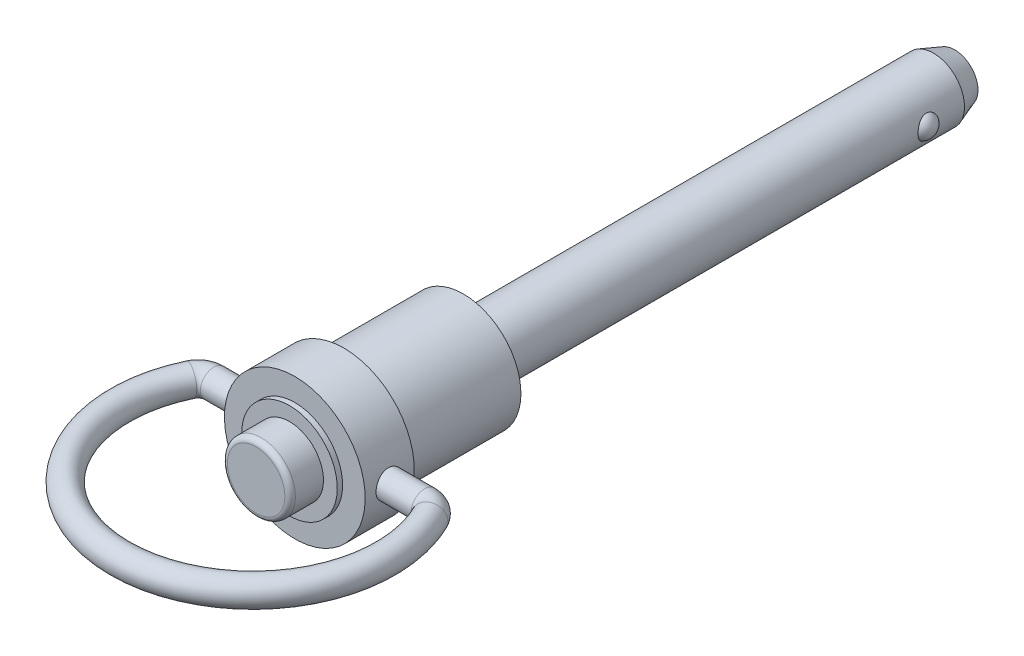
ISO-10303-21;
HEADER;
FILE_DESCRIPTION(('STEP AP214'),'2;1');
FILE_NAME('part.step','',(''),(''),'','','');
FILE_SCHEMA(('AUTOMOTIVE_DESIGN { 1 0 10303 214 1 1 1 1 }'));
ENDSEC;
DATA;
#1=APPLICATION_CONTEXT('core data for automotive mechanical design processes');
#2=APPLICATION_PROTOCOL_DEFINITION('international standard','automotive_design',2000,#1);
#3=PRODUCT_CONTEXT('',#1,'mechanical');
#4=PRODUCT('Part','Part','',(#3));
#5=PRODUCT_RELATED_PRODUCT_CATEGORY('part','',(#4));
#6=PRODUCT_DEFINITION_FORMATION('','',#4);
#7=PRODUCT_DEFINITION_CONTEXT('part definition',#1,'design');
#8=PRODUCT_DEFINITION('design','',#6,#7);
#9=PRODUCT_DEFINITION_SHAPE('','',#8);
#10=(LENGTH_UNIT() NAMED_UNIT(*) SI_UNIT(.MILLI.,.METRE.));
#11=(NAMED_UNIT(*) PLANE_ANGLE_UNIT() SI_UNIT($,.RADIAN.));
#12=(NAMED_UNIT(*) SI_UNIT($,.STERADIAN.) SOLID_ANGLE_UNIT());
#13=UNCERTAINTY_MEASURE_WITH_UNIT(LENGTH_MEASURE(1.E-05),#10,'distance_accuracy_value','');
#14=(GEOMETRIC_REPRESENTATION_CONTEXT(3) GLOBAL_UNCERTAINTY_ASSIGNED_CONTEXT((#13)) GLOBAL_UNIT_ASSIGNED_CONTEXT((#10,
#11,#12)) REPRESENTATION_CONTEXT('',''));
#15=CARTESIAN_POINT('',(0.,0.,0.));
#16=DIRECTION('',(0.,0.,1.));
#17=DIRECTION('',(1.,0.,0.));
#18=AXIS2_PLACEMENT_3D('',#15,#16,#17);
#19=CARTESIAN_POINT('',(0.,0.,20.828));
#20=DIRECTION('',(0.,0.,-1.));
#21=DIRECTION('',(0.,1.,0.));
#22=AXIS2_PLACEMENT_3D('',#19,#20,#21);
#23=CYLINDRICAL_SURFACE('',#22,3.2512);
#24=CARTESIAN_POINT('',(0.,0.,16.637));
#25=DIRECTION('',(0.,0.,-1.));
#26=DIRECTION('',(0.,1.,0.));
#27=AXIS2_PLACEMENT_3D('',#24,#25,#26);
#28=CIRCLE('',#27,3.2512);
#29=CARTESIAN_POINT('',(0.,3.2512,16.637));
#30=VERTEX_POINT('',#29);
#31=EDGE_CURVE('E35',#30,#30,#28,.T.);
#32=ORIENTED_EDGE('',*,*,#31,.F.);
#33=EDGE_LOOP('',(#32));
#34=FACE_BOUND('',#33,.T.);
#35=CARTESIAN_POINT('',(0.,0.,19.328));
#36=DIRECTION('',(0.,0.,1.));
#37=DIRECTION('',(1.,0.,0.));
#38=AXIS2_PLACEMENT_3D('',#35,#36,#37);
#39=CIRCLE('',#38,3.2512);
#40=CARTESIAN_POINT('',(3.2512,0.,19.328));
#41=VERTEX_POINT('',#40);
#42=EDGE_CURVE('E157',#41,#41,#39,.T.);
#43=ORIENTED_EDGE('',*,*,#42,.F.);
#44=EDGE_LOOP('',(#43));
#45=FACE_BOUND('',#44,.T.);
#46=ADVANCED_FACE('F13',(#34,#45),#23,.T.);
#47=CARTESIAN_POINT('',(4.572,0.,16.637));
#48=DIRECTION('',(0.,0.,1.));
#49=DIRECTION('',(0.,-1.,0.));
#50=AXIS2_PLACEMENT_3D('',#47,#48,#49);
#51=PLANE('',#50);
#52=ORIENTED_EDGE('',*,*,#31,.T.);
#53=EDGE_LOOP('',(#52));
#54=FACE_BOUND('',#53,.T.);
#55=CARTESIAN_POINT('',(0.,0.,16.637));
#56=DIRECTION('',(0.,0.,-1.));
#57=DIRECTION('',(0.,1.,0.));
#58=AXIS2_PLACEMENT_3D('',#55,#56,#57);
#59=CIRCLE('',#58,4.572);
#60=CARTESIAN_POINT('',(0.,4.572,16.637));
#61=VERTEX_POINT('',#60);
#62=EDGE_CURVE('E40',#61,#61,#59,.T.);
#63=ORIENTED_EDGE('',*,*,#62,.F.);
#64=EDGE_LOOP('',(#63));
#65=FACE_BOUND('',#64,.T.);
#66=ADVANCED_FACE('F81',(#54,#65),#51,.T.);
#67=CARTESIAN_POINT('',(0.,0.,0.));
#68=DIRECTION('',(0.,0.,-1.));
#69=DIRECTION('',(0.,1.,0.));
#70=AXIS2_PLACEMENT_3D('',#67,#68,#69);
#71=CYLINDRICAL_SURFACE('',#70,4.572);
#72=ORIENTED_EDGE('',*,*,#62,.T.);
#73=EDGE_LOOP('',(#72));
#74=FACE_BOUND('',#73,.T.);
#75=CARTESIAN_POINT('',(0.,0.,16.129));
#76=DIRECTION('',(0.,0.,-1.));
#77=DIRECTION('',(0.,1.,0.));
#78=AXIS2_PLACEMENT_3D('',#75,#76,#77);
#79=CIRCLE('',#78,4.572);
#80=CARTESIAN_POINT('',(0.,4.572,16.129));
#81=VERTEX_POINT('',#80);
#82=EDGE_CURVE('E43',#81,#81,#79,.T.);
#83=ORIENTED_EDGE('',*,*,#82,.F.);
#84=EDGE_LOOP('',(#83));
#85=FACE_BOUND('',#84,.T.);
#86=ADVANCED_FACE('F151',(#74,#85),#71,.T.);
#87=CARTESIAN_POINT('',(6.731,0.,16.129));
#88=DIRECTION('',(0.,0.,1.));
#89=DIRECTION('',(0.,-1.,0.));
#90=AXIS2_PLACEMENT_3D('',#87,#88,#89);
#91=PLANE('',#90);
#92=CARTESIAN_POINT('',(0.,0.,16.129));
#93=DIRECTION('',(0.,0.,-1.));
#94=DIRECTION('',(0.,1.,0.));
#95=AXIS2_PLACEMENT_3D('',#92,#93,#94);
#96=CIRCLE('',#95,6.731);
#97=CARTESIAN_POINT('',(0.,6.731,16.129));
#98=VERTEX_POINT('',#97);
#99=EDGE_CURVE('E46',#98,#98,#96,.T.);
#100=ORIENTED_EDGE('',*,*,#99,.F.);
#101=EDGE_LOOP('',(#100));
#102=FACE_BOUND('',#101,.T.);
#103=ORIENTED_EDGE('',*,*,#82,.T.);
#104=EDGE_LOOP('',(#103));
#105=FACE_BOUND('',#104,.T.);
#106=ADVANCED_FACE('F194',(#102,#105),#91,.T.);
#107=CARTESIAN_POINT('',(0.,0.,0.));
#108=DIRECTION('',(0.,0.,-1.));
#109=DIRECTION('',(0.,1.,0.));
#110=AXIS2_PLACEMENT_3D('',#107,#108,#109);
#111=CYLINDRICAL_SURFACE('',#110,6.731);
#112=CARTESIAN_POINT('',(0.,0.,11.43));
#113=DIRECTION('',(0.,0.,-1.));
#114=DIRECTION('',(0.,1.,0.));
#115=AXIS2_PLACEMENT_3D('',#112,#113,#114);
#116=CIRCLE('',#115,6.731);
#117=CARTESIAN_POINT('',(0.,6.731,11.43));
#118=VERTEX_POINT('',#117);
#119=EDGE_CURVE('E34',#118,#118,#116,.T.);
#120=ORIENTED_EDGE('',*,*,#119,.F.);
#121=EDGE_LOOP('',(#120));
#122=FACE_BOUND('',#121,.T.);
#123=ORIENTED_EDGE('',*,*,#99,.T.);
#124=EDGE_LOOP('',(#123));
#125=FACE_BOUND('',#124,.T.);
#126=CARTESIAN_POINT('',(-6.6051722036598,1.2954,13.7922));
#127=CARTESIAN_POINT('',(-6.60517361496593,1.2953972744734,13.864236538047));
#128=CARTESIAN_POINT('',(-6.60636346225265,1.28937073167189,13.9363080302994));
#129=CARTESIAN_POINT('',(-6.61098794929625,1.26544153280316,14.0784162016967));
#130=CARTESIAN_POINT('',(-6.61442445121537,1.24752902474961,14.1484511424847));
#131=CARTESIAN_POINT('',(-6.62313895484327,1.20040052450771,14.2844095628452));
#132=CARTESIAN_POINT('',(-6.62841519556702,1.17119533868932,14.3503369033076));
#133=CARTESIAN_POINT('',(-6.64021258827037,1.10233951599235,14.4763528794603));
#134=CARTESIAN_POINT('',(-6.64673365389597,1.06268960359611,14.5364419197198));
#135=CARTESIAN_POINT('',(-6.66038139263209,0.973516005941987,14.6498669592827));
#136=CARTESIAN_POINT('',(-6.66751428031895,0.9238817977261,14.7031153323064));
#137=CARTESIAN_POINT('',(-6.68152715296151,0.816387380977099,14.8005834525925));
#138=CARTESIAN_POINT('',(-6.6884071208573,0.758526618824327,14.8448025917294));
#139=CARTESIAN_POINT('',(-6.7012057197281,0.635644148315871,14.9232944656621));
#140=CARTESIAN_POINT('',(-6.70711617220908,0.570568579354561,14.9574843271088));
#141=CARTESIAN_POINT('',(-6.71724013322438,0.435464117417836,15.014412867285));
#142=CARTESIAN_POINT('',(-6.72145378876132,0.365435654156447,15.0371525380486));
#143=CARTESIAN_POINT('',(-6.72766549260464,0.223321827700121,15.0702635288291));
#144=CARTESIAN_POINT('',(-6.72968999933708,0.151272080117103,15.0807826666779));
#145=CARTESIAN_POINT('',(-6.73138656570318,0.00640388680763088,15.089614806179));
#146=CARTESIAN_POINT('',(-6.73105883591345,-0.0664144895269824,15.0879289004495));
#147=CARTESIAN_POINT('',(-6.72810846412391,-0.209738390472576,15.072511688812));
#148=CARTESIAN_POINT('',(-6.72551615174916,-0.280261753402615,15.0589395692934));
#149=CARTESIAN_POINT('',(-6.71836197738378,-0.418011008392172,15.0203872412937));
#150=CARTESIAN_POINT('',(-6.71380004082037,-0.485236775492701,14.9954066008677));
#151=CARTESIAN_POINT('',(-6.70316878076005,-0.614941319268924,14.9345963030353));
#152=CARTESIAN_POINT('',(-6.69709072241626,-0.67738974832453,14.8987035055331));
#153=CARTESIAN_POINT('',(-6.68409856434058,-0.795436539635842,14.8171343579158));
#154=CARTESIAN_POINT('',(-6.677184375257,-0.851034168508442,14.7714569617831));
#155=CARTESIAN_POINT('',(-6.66315320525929,-0.954744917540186,14.6707395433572));
#156=CARTESIAN_POINT('',(-6.65603475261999,-1.00272266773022,14.6155602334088));
#157=CARTESIAN_POINT('',(-6.64250376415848,-1.08876420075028,14.4978679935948));
#158=CARTESIAN_POINT('',(-6.63609123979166,-1.12682782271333,14.4353549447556));
#159=CARTESIAN_POINT('',(-6.62469571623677,-1.19200234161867,14.3045844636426));
#160=CARTESIAN_POINT('',(-6.61971540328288,-1.21909269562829,14.2363165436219));
#161=CARTESIAN_POINT('',(-6.61178862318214,-1.26138008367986,14.0960804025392));
#162=CARTESIAN_POINT('',(-6.60884191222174,-1.27657854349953,14.0241126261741));
#163=CARTESIAN_POINT('',(-6.60536444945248,-1.29445125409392,13.8797427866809));
#164=CARTESIAN_POINT('',(-6.60479610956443,-1.29732037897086,13.8073657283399));
#165=CARTESIAN_POINT('',(-6.60603903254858,-1.29097613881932,13.6631669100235));
#166=CARTESIAN_POINT('',(-6.60785017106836,-1.28176340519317,13.5913451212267));
#167=CARTESIAN_POINT('',(-6.6136128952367,-1.25168453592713,13.4509418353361));
#168=CARTESIAN_POINT('',(-6.61754556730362,-1.23092132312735,13.3823374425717));
#169=CARTESIAN_POINT('',(-6.62709183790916,-1.17844042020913,13.249581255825));
#170=CARTESIAN_POINT('',(-6.63270556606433,-1.14672188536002,13.1854298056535));
#171=CARTESIAN_POINT('',(-6.6450665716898,-1.07278507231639,13.0625442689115));
#172=CARTESIAN_POINT('',(-6.65182676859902,-1.03044414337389,13.0038853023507));
#173=CARTESIAN_POINT('',(-6.66568301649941,-0.936629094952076,12.8944341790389));
#174=CARTESIAN_POINT('',(-6.67277909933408,-0.885154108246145,12.8436427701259));
#175=CARTESIAN_POINT('',(-6.68662882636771,-0.773660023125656,12.7506362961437));
#176=CARTESIAN_POINT('',(-6.69337621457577,-0.713530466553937,12.7085525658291));
#177=CARTESIAN_POINT('',(-6.70566168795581,-0.586941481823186,12.6350847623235));
#178=CARTESIAN_POINT('',(-6.71119982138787,-0.520482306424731,12.6037002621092));
#179=CARTESIAN_POINT('',(-6.72041595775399,-0.383476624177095,12.5527164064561));
#180=CARTESIAN_POINT('',(-6.72410395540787,-0.312954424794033,12.5330536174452));
#181=CARTESIAN_POINT('',(-6.72924701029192,-0.169530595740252,12.5058694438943));
#182=CARTESIAN_POINT('',(-6.7307023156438,-0.0966292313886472,12.4983467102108));
#183=CARTESIAN_POINT('',(-6.73121071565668,0.0482259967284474,12.4957052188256));
#184=CARTESIAN_POINT('',(-6.73030215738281,0.120176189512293,12.5003884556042));
#185=CARTESIAN_POINT('',(-6.72626496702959,0.26224403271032,12.5215909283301));
#186=CARTESIAN_POINT('',(-6.72313635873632,0.332361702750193,12.5381100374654));
#187=CARTESIAN_POINT('',(-6.71501101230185,0.468662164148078,12.5824301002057));
#188=CARTESIAN_POINT('',(-6.710017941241,0.534852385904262,12.6102089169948));
#189=CARTESIAN_POINT('',(-6.69870305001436,0.661661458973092,12.6762356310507));
#190=CARTESIAN_POINT('',(-6.69238113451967,0.722279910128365,12.7144842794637));
#191=CARTESIAN_POINT('',(-6.6789853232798,0.837208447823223,12.8010411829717));
#192=CARTESIAN_POINT('',(-6.67190155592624,0.891410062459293,12.8494919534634));
#193=CARTESIAN_POINT('',(-6.65784127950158,0.990982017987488,12.95478313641));
#194=CARTESIAN_POINT('',(-6.65086479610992,1.03635027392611,13.0116255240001));
#195=CARTESIAN_POINT('',(-6.63773378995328,1.11738877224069,13.1327559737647));
#196=CARTESIAN_POINT('',(-6.63158802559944,1.15295925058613,13.1971117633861));
#197=CARTESIAN_POINT('',(-6.62092027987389,1.21272619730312,13.3309847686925));
#198=CARTESIAN_POINT('',(-6.61639678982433,1.23693323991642,13.4004971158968));
#199=CARTESIAN_POINT('',(-6.61041337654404,1.26845390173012,13.5238636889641));
#200=CARTESIAN_POINT('',(-6.60845980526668,1.27854107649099,13.57700269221));
#201=CARTESIAN_POINT('',(-6.60583870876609,1.29201504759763,13.6841545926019));
#202=CARTESIAN_POINT('',(-6.60517114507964,1.29540204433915,13.7381674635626));
#203=CARTESIAN_POINT('',(-6.6051722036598,1.2954,13.7922));
#204=B_SPLINE_CURVE_WITH_KNOTS('',3,(#126,#127,#128,#129,#130,#131,#132,#133,#134,#135,#136,
#137,#138,#139,#140,#141,#142,#143,#144,#145,#146,#147,#148,#149,#150,#151,#152,#153,#154,#155,
#156,#157,#158,#159,#160,#161,#162,#163,#164,#165,#166,#167,#168,#169,#170,#171,#172,#173,#174,
#175,#176,#177,#178,#179,#180,#181,#182,#183,#184,#185,#186,#187,#188,#189,#190,#191,#192,#193,
#194,#195,#196,#197,#198,#199,#200,#201,#202,#203),.UNSPECIFIED.,.T.,.F.,(4,2,2,2,2,2,2,2,2,2,2,
2,2,2,2,2,2,2,2,2,2,2,2,2,2,2,2,2,2,2,2,2,2,2,2,2,2,2,4),(0.,0.215911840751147,
0.432002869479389,0.64788762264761,0.86375740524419,1.08216318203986,1.30058366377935,
1.52076118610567,1.74091962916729,1.95838638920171,2.1758336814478,2.39041258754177,
2.60499961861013,2.82085272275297,3.0367289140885,3.25609136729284,3.47545737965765,
3.69523218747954,3.91498064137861,4.13124273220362,4.34749352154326,4.56184753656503,
4.7762180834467,4.99318797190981,5.21017847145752,5.430235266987,5.65028327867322,
5.86912939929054,6.08795119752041,6.30324544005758,6.51853737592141,6.73340808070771,
6.94829420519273,7.16640910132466,7.38457541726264,7.60488731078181,7.82499378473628,
7.9869478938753,8.14889715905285),.UNSPECIFIED.);
#205=CARTESIAN_POINT('',(-6.6051722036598,1.2954,13.7922));
#206=VERTEX_POINT('',#205);
#207=EDGE_CURVE('E28',#206,#206,#204,.T.);
#208=ORIENTED_EDGE('',*,*,#207,.T.);
#209=EDGE_LOOP('',(#208));
#210=FACE_BOUND('',#209,.T.);
#211=CARTESIAN_POINT('',(6.6051722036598,1.2954,13.7922));
#212=CARTESIAN_POINT('',(6.60517361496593,1.2953972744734,13.720163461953));
#213=CARTESIAN_POINT('',(6.60636346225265,1.2893707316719,13.6480919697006));
#214=CARTESIAN_POINT('',(6.61098794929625,1.26544153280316,13.5059837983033));
#215=CARTESIAN_POINT('',(6.61442445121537,1.24752902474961,13.4359488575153));
#216=CARTESIAN_POINT('',(6.62313895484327,1.20040052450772,13.2999904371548));
#217=CARTESIAN_POINT('',(6.62841519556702,1.17119533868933,13.2340630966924));
#218=CARTESIAN_POINT('',(6.64021258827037,1.10233951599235,13.1080471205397));
#219=CARTESIAN_POINT('',(6.64673365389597,1.06268960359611,13.0479580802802));
#220=CARTESIAN_POINT('',(6.66038139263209,0.973516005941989,12.9345330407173));
#221=CARTESIAN_POINT('',(6.66751428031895,0.923881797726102,12.8812846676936));
#222=CARTESIAN_POINT('',(6.68152715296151,0.816387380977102,12.7838165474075));
#223=CARTESIAN_POINT('',(6.6884071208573,0.758526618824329,12.7395974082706));
#224=CARTESIAN_POINT('',(6.7012057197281,0.635644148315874,12.6611055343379));
#225=CARTESIAN_POINT('',(6.70711617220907,0.570568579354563,12.6269156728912));
#226=CARTESIAN_POINT('',(6.71724013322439,0.435464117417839,12.569987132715));
#227=CARTESIAN_POINT('',(6.72145378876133,0.36543565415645,12.5472474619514));
#228=CARTESIAN_POINT('',(6.72766549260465,0.223321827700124,12.5141364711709));
#229=CARTESIAN_POINT('',(6.72968999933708,0.151272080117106,12.5036173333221));
#230=CARTESIAN_POINT('',(6.73138656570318,0.00640388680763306,12.494785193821));
#231=CARTESIAN_POINT('',(6.73105883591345,-0.0664144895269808,12.4964710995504));
#232=CARTESIAN_POINT('',(6.72810846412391,-0.209738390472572,12.511888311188));
#233=CARTESIAN_POINT('',(6.72551615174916,-0.280261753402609,12.5254604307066));
#234=CARTESIAN_POINT('',(6.71836197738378,-0.418011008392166,12.5640127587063));
#235=CARTESIAN_POINT('',(6.71380004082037,-0.4852367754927,12.5889933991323));
#236=CARTESIAN_POINT('',(6.70316878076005,-0.614941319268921,12.6498036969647));
#237=CARTESIAN_POINT('',(6.69709072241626,-0.67738974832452,12.6856964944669));
#238=CARTESIAN_POINT('',(6.68409856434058,-0.795436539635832,12.7672656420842));
#239=CARTESIAN_POINT('',(6.677184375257,-0.851034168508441,12.8129430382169));
#240=CARTESIAN_POINT('',(6.66315320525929,-0.954744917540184,12.9136604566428));
#241=CARTESIAN_POINT('',(6.65603475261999,-1.00272266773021,12.9688397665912));
#242=CARTESIAN_POINT('',(6.64250376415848,-1.08876420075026,13.0865320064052));
#243=CARTESIAN_POINT('',(6.63609123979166,-1.12682782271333,13.1490450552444));
#244=CARTESIAN_POINT('',(6.62469571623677,-1.19200234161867,13.2798155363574));
#245=CARTESIAN_POINT('',(6.61971540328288,-1.21909269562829,13.3480834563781));
#246=CARTESIAN_POINT('',(6.61178862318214,-1.26138008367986,13.4883195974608));
#247=CARTESIAN_POINT('',(6.60884191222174,-1.27657854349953,13.5602873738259));
#248=CARTESIAN_POINT('',(6.60536444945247,-1.29445125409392,13.7046572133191));
#249=CARTESIAN_POINT('',(6.60479610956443,-1.29732037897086,13.7770342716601));
#250=CARTESIAN_POINT('',(6.60603903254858,-1.29097613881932,13.9212330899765));
#251=CARTESIAN_POINT('',(6.60785017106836,-1.28176340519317,13.9930548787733));
#252=CARTESIAN_POINT('',(6.6136128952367,-1.25168453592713,14.1334581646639));
#253=CARTESIAN_POINT('',(6.61754556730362,-1.23092132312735,14.2020625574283));
#254=CARTESIAN_POINT('',(6.62709183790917,-1.17844042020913,14.334818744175));
#255=CARTESIAN_POINT('',(6.63270556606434,-1.14672188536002,14.3989701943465));
#256=CARTESIAN_POINT('',(6.64506657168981,-1.07278507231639,14.5218557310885));
#257=CARTESIAN_POINT('',(6.65182676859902,-1.03044414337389,14.5805146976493));
#258=CARTESIAN_POINT('',(6.66568301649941,-0.936629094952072,14.6899658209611));
#259=CARTESIAN_POINT('',(6.67277909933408,-0.885154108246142,14.7407572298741));
#260=CARTESIAN_POINT('',(6.68662882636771,-0.773660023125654,14.8337637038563));
#261=CARTESIAN_POINT('',(6.69337621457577,-0.713530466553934,14.8758474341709));
#262=CARTESIAN_POINT('',(6.70566168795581,-0.586941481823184,14.9493152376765));
#263=CARTESIAN_POINT('',(6.71119982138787,-0.520482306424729,14.9806997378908));
#264=CARTESIAN_POINT('',(6.72041595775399,-0.383476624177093,15.0316835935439));
#265=CARTESIAN_POINT('',(6.72410395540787,-0.31295442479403,15.0513463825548));
#266=CARTESIAN_POINT('',(6.72924701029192,-0.169530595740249,15.0785305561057));
#267=CARTESIAN_POINT('',(6.7307023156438,-0.0966292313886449,15.0860532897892));
#268=CARTESIAN_POINT('',(6.73121071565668,0.0482259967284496,15.0886947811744));
#269=CARTESIAN_POINT('',(6.73030215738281,0.120176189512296,15.0840115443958));
#270=CARTESIAN_POINT('',(6.72626496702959,0.262244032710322,15.0628090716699));
#271=CARTESIAN_POINT('',(6.72313635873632,0.332361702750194,15.0462899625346));
#272=CARTESIAN_POINT('',(6.71501101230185,0.46866216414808,15.0019698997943));
#273=CARTESIAN_POINT('',(6.710017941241,0.534852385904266,14.9741910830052));
#274=CARTESIAN_POINT('',(6.69870305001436,0.661661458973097,14.9081643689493));
#275=CARTESIAN_POINT('',(6.69238113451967,0.722279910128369,14.8699157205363));
#276=CARTESIAN_POINT('',(6.6789853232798,0.837208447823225,14.7833588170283));
#277=CARTESIAN_POINT('',(6.67190155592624,0.891410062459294,14.7349080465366));
#278=CARTESIAN_POINT('',(6.65784127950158,0.990982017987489,14.62961686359));
#279=CARTESIAN_POINT('',(6.65086479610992,1.03635027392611,14.5727744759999));
#280=CARTESIAN_POINT('',(6.63773378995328,1.1173887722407,14.4516440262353));
#281=CARTESIAN_POINT('',(6.63158802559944,1.15295925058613,14.3872882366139));
#282=CARTESIAN_POINT('',(6.62092027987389,1.21272619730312,14.2534152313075));
#283=CARTESIAN_POINT('',(6.61639678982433,1.23693323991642,14.1839028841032));
#284=CARTESIAN_POINT('',(6.61041337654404,1.26845390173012,14.0605363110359));
#285=CARTESIAN_POINT('',(6.60845980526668,1.27854107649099,14.00739730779));
#286=CARTESIAN_POINT('',(6.60583870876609,1.29201504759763,13.9002454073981));
#287=CARTESIAN_POINT('',(6.60517114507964,1.29540204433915,13.8462325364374));
#288=CARTESIAN_POINT('',(6.6051722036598,1.2954,13.7922));
#289=B_SPLINE_CURVE_WITH_KNOTS('',3,(#211,#212,#213,#214,#215,#216,#217,#218,#219,#220,#221,
#222,#223,#224,#225,#226,#227,#228,#229,#230,#231,#232,#233,#234,#235,#236,#237,#238,#239,#240,
#241,#242,#243,#244,#245,#246,#247,#248,#249,#250,#251,#252,#253,#254,#255,#256,#257,#258,#259,
#260,#261,#262,#263,#264,#265,#266,#267,#268,#269,#270,#271,#272,#273,#274,#275,#276,#277,#278,
#279,#280,#281,#282,#283,#284,#285,#286,#287,#288),.UNSPECIFIED.,.T.,.F.,(4,2,2,2,2,2,2,2,2,2,2,
2,2,2,2,2,2,2,2,2,2,2,2,2,2,2,2,2,2,2,2,2,2,2,2,2,2,2,4),(0.,0.215911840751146,
0.432002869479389,0.64788762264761,0.86375740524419,1.08216318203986,1.30058366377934,
1.52076118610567,1.74091962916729,1.95838638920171,2.1758336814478,2.39041258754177,
2.60499961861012,2.82085272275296,3.0367289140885,3.25609136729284,3.47545737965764,
3.69523218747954,3.91498064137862,4.13124273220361,4.34749352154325,4.56184753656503,
4.77621808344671,4.99318797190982,5.21017847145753,5.43023526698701,5.65028327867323,
5.86912939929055,6.08795119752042,6.30324544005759,6.51853737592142,6.73340808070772,
6.94829420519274,7.16640910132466,7.38457541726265,7.60488731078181,7.82499378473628,
7.98694789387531,8.14889715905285),.UNSPECIFIED.);
#290=CARTESIAN_POINT('',(6.6051722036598,1.2954,13.7922));
#291=VERTEX_POINT('',#290);
#292=EDGE_CURVE('E24',#291,#291,#289,.T.);
#293=ORIENTED_EDGE('',*,*,#292,.T.);
#294=EDGE_LOOP('',(#293));
#295=FACE_BOUND('',#294,.T.);
#296=ADVANCED_FACE('F143',(#122,#125,#210,#295),#111,.T.);
#297=CARTESIAN_POINT('',(5.7785,0.,11.43));
#298=DIRECTION('',(0.,0.,-1.));
#299=DIRECTION('',(0.,1.,0.));
#300=AXIS2_PLACEMENT_3D('',#297,#298,#299);
#301=PLANE('',#300);
#302=CARTESIAN_POINT('',(0.,0.,11.43));
#303=DIRECTION('',(0.,0.,-1.));
#304=DIRECTION('',(0.,1.,0.));
#305=AXIS2_PLACEMENT_3D('',#302,#303,#304);
#306=CIRCLE('',#305,5.9);
#307=CARTESIAN_POINT('',(0.,5.9,11.43));
#308=VERTEX_POINT('',#307);
#309=EDGE_CURVE('E20',#308,#308,#306,.F.);
#310=ORIENTED_EDGE('',*,*,#309,.T.);
#311=EDGE_LOOP('',(#310));
#312=FACE_BOUND('',#311,.T.);
#313=ORIENTED_EDGE('',*,*,#119,.T.);
#314=EDGE_LOOP('',(#313));
#315=FACE_BOUND('',#314,.T.);
#316=ADVANCED_FACE('F137',(#312,#315),#301,.T.);
#317=CARTESIAN_POINT('',(10.0803124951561,0.,15.3162));
#318=DIRECTION('',(0.,1.,0.));
#319=DIRECTION('',(-1.,0.,0.));
#320=AXIS2_PLACEMENT_3D('',#317,#318,#319);
#321=TOROIDAL_SURFACE('',#320,1.524,1.2954);
#322=CARTESIAN_POINT('',(11.4549005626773,0.,14.658109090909));
#323=DIRECTION('',(-0.431818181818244,0.,-0.901960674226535));
#324=DIRECTION('',(0.901960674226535,0.,-0.431818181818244));
#325=AXIS2_PLACEMENT_3D('',#322,#323,#324);
#326=CIRCLE('',#325,1.2954);
#327=CARTESIAN_POINT('',(12.6233004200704,0.,14.0987318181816));
#328=VERTEX_POINT('',#327);
#329=EDGE_CURVE('E51',#328,#328,#326,.T.);
#330=ORIENTED_EDGE('',*,*,#329,.T.);
#331=EDGE_LOOP('',(#330));
#332=FACE_BOUND('',#331,.T.);
#333=CARTESIAN_POINT('',(10.0803124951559,0.,13.7922));
#334=DIRECTION('',(1.,0.,0.));
#335=DIRECTION('',(0.,1.,0.));
#336=AXIS2_PLACEMENT_3D('',#333,#334,#335);
#337=CIRCLE('',#336,1.2954);
#338=CARTESIAN_POINT('',(10.0803124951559,1.2954,13.7922));
#339=VERTEX_POINT('',#338);
#340=EDGE_CURVE('E39',#339,#339,#337,.F.);
#341=ORIENTED_EDGE('',*,*,#340,.F.);
#342=EDGE_LOOP('',(#341));
#343=FACE_BOUND('',#342,.T.);
#344=ADVANCED_FACE('F79',(#332,#343),#321,.T.);
#345=CARTESIAN_POINT('',(-10.0803124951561,0.,13.7922));
#346=DIRECTION('',(1.,0.,0.));
#347=DIRECTION('',(0.,1.,0.));
#348=AXIS2_PLACEMENT_3D('',#345,#346,#347);
#349=CYLINDRICAL_SURFACE('',#348,1.2954);
#350=ORIENTED_EDGE('',*,*,#292,.F.);
#351=EDGE_LOOP('',(#350));
#352=FACE_BOUND('',#351,.T.);
#353=ORIENTED_EDGE('',*,*,#340,.T.);
#354=EDGE_LOOP('',(#353));
#355=FACE_BOUND('',#354,.T.);
#356=ADVANCED_FACE('F75',(#352,#355),#349,.T.);
#357=CARTESIAN_POINT('',(0.,0.,20.1422));
#358=DIRECTION('',(0.,1.,0.));
#359=DIRECTION('',(-1.,0.,0.));
#360=AXIS2_PLACEMENT_3D('',#357,#358,#359);
#361=TOROIDAL_SURFACE('',#360,12.7,1.2954);
#362=CARTESIAN_POINT('',(-11.4549005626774,0.,14.6581090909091));
#363=DIRECTION('',(-0.43181818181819,0.,0.901960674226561));
#364=DIRECTION('',(-0.901960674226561,0.,-0.43181818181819));
#365=AXIS2_PLACEMENT_3D('',#362,#363,#364);
#366=CIRCLE('',#365,1.2954);
#367=CARTESIAN_POINT('',(-12.6233004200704,0.,14.0987318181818));
#368=VERTEX_POINT('',#367);
#369=EDGE_CURVE('E54',#368,#368,#366,.F.);
#370=ORIENTED_EDGE('',*,*,#369,.F.);
#371=EDGE_LOOP('',(#370));
#372=FACE_BOUND('',#371,.T.);
#373=ORIENTED_EDGE('',*,*,#329,.F.);
#374=EDGE_LOOP('',(#373));
#375=FACE_BOUND('',#374,.T.);
#376=ADVANCED_FACE('F72',(#372,#375),#361,.T.);
#377=CARTESIAN_POINT('',(-10.0803124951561,0.,15.3162));
#378=DIRECTION('',(0.,1.,0.));
#379=DIRECTION('',(-1.,0.,0.));
#380=AXIS2_PLACEMENT_3D('',#377,#378,#379);
#381=TOROIDAL_SURFACE('',#380,1.524,1.2954);
#382=CARTESIAN_POINT('',(-10.0803124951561,0.,13.7922));
#383=DIRECTION('',(1.,0.,0.));
#384=DIRECTION('',(0.,1.,0.));
#385=AXIS2_PLACEMENT_3D('',#382,#383,#384);
#386=CIRCLE('',#385,1.2954);
#387=CARTESIAN_POINT('',(-10.0803124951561,1.2954,13.7922));
#388=VERTEX_POINT('',#387);
#389=EDGE_CURVE('E38',#388,#388,#386,.T.);
#390=ORIENTED_EDGE('',*,*,#389,.F.);
#391=EDGE_LOOP('',(#390));
#392=FACE_BOUND('',#391,.T.);
#393=ORIENTED_EDGE('',*,*,#369,.T.);
#394=EDGE_LOOP('',(#393));
#395=FACE_BOUND('',#394,.T.);
#396=ADVANCED_FACE('F67',(#392,#395),#381,.T.);
#397=CARTESIAN_POINT('',(-10.0803124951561,0.,13.7922));
#398=DIRECTION('',(1.,0.,0.));
#399=DIRECTION('',(0.,1.,0.));
#400=AXIS2_PLACEMENT_3D('',#397,#398,#399);
#401=CYLINDRICAL_SURFACE('',#400,1.2954);
#402=ORIENTED_EDGE('',*,*,#207,.F.);
#403=EDGE_LOOP('',(#402));
#404=FACE_BOUND('',#403,.T.);
#405=ORIENTED_EDGE('',*,*,#389,.T.);
#406=EDGE_LOOP('',(#405));
#407=FACE_BOUND('',#406,.T.);
#408=ADVANCED_FACE('F71',(#404,#407),#401,.T.);
#409=CARTESIAN_POINT('',(0.,0.,19.328));
#410=DIRECTION('',(0.,0.,1.));
#411=DIRECTION('',(1.,0.,0.));
#412=AXIS2_PLACEMENT_3D('',#409,#410,#411);
#413=TOROIDAL_SURFACE('',#412,2.7512,0.5);
#414=CARTESIAN_POINT('',(0.,0.,19.828));
#415=DIRECTION('',(0.,0.,1.));
#416=DIRECTION('',(1.,0.,0.));
#417=AXIS2_PLACEMENT_3D('',#414,#415,#416);
#418=CIRCLE('',#417,2.7512);
#419=CARTESIAN_POINT('',(2.7512,0.,19.828));
#420=VERTEX_POINT('',#419);
#421=EDGE_CURVE('E159',#420,#420,#418,.T.);
#422=ORIENTED_EDGE('',*,*,#421,.F.);
#423=EDGE_LOOP('',(#422));
#424=FACE_BOUND('',#423,.T.);
#425=ORIENTED_EDGE('',*,*,#42,.T.);
#426=EDGE_LOOP('',(#425));
#427=FACE_BOUND('',#426,.T.);
#428=ADVANCED_FACE('F98',(#424,#427),#413,.T.);
#429=CARTESIAN_POINT('',(0.,0.,19.828));
#430=DIRECTION('',(0.,0.,-1.));
#431=DIRECTION('',(-1.,0.,0.));
#432=AXIS2_PLACEMENT_3D('',#429,#430,#431);
#433=PLANE('',#432);
#434=ORIENTED_EDGE('',*,*,#421,.T.);
#435=EDGE_LOOP('',(#434));
#436=FACE_BOUND('',#435,.T.);
#437=ADVANCED_FACE('F171',(#436),#433,.F.);
#438=CARTESIAN_POINT('',(0.,0.,49.089321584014));
#439=DIRECTION('',(0.,0.,-1.));
#440=DIRECTION('',(0.,1.,0.));
#441=AXIS2_PLACEMENT_3D('',#438,#439,#440);
#442=CYLINDRICAL_SURFACE('',#441,5.5);
#443=CARTESIAN_POINT('',(0.,0.,11.03));
#444=DIRECTION('',(0.,0.,-1.));
#445=DIRECTION('',(0.,1.,0.));
#446=AXIS2_PLACEMENT_3D('',#443,#444,#445);
#447=CIRCLE('',#446,5.5);
#448=CARTESIAN_POINT('',(0.,5.5,11.03));
#449=VERTEX_POINT('',#448);
#450=EDGE_CURVE('E8',#449,#449,#447,.T.);
#451=ORIENTED_EDGE('',*,*,#450,.T.);
#452=EDGE_LOOP('',(#451));
#453=FACE_BOUND('',#452,.T.);
#454=CARTESIAN_POINT('',(0.,0.,0.));
#455=DIRECTION('',(0.,0.,-1.));
#456=DIRECTION('',(0.,1.,0.));
#457=AXIS2_PLACEMENT_3D('',#454,#455,#456);
#458=CIRCLE('',#457,5.5);
#459=CARTESIAN_POINT('',(0.,5.5,0.));
#460=VERTEX_POINT('',#459);
#461=EDGE_CURVE('E162',#460,#460,#458,.T.);
#462=ORIENTED_EDGE('',*,*,#461,.F.);
#463=EDGE_LOOP('',(#462));
#464=FACE_BOUND('',#463,.T.);
#465=ADVANCED_FACE('F105',(#453,#464),#442,.T.);
#466=CARTESIAN_POINT('',(2.23030748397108,0.,-46.9964));
#467=DIRECTION('',(0.,0.,1.));
#468=DIRECTION('',(0.,-1.,0.));
#469=AXIS2_PLACEMENT_3D('',#466,#467,#468);
#470=PLANE('',#469);
#471=CARTESIAN_POINT('',(0.,0.,-46.9963999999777));
#472=DIRECTION('',(0.,0.,1.));
#473=DIRECTION('',(0.,-1.,0.));
#474=AXIS2_PLACEMENT_3D('',#471,#472,#473);
#475=CIRCLE('',#474,2.23030748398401);
#476=CARTESIAN_POINT('',(0.,-2.23030748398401,-46.9963999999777));
#477=VERTEX_POINT('',#476);
#478=EDGE_CURVE('E124',#477,#477,#475,.T.);
#479=ORIENTED_EDGE('',*,*,#478,.F.);
#480=EDGE_LOOP('',(#479));
#481=FACE_BOUND('',#480,.T.);
#482=ADVANCED_FACE('F100',(#481),#470,.F.);
#483=CARTESIAN_POINT('',(2.304415,0.,-41.51));
#484=DIRECTION('',(0.,0.,1.));
#485=DIRECTION('',(1.,0.,0.));
#486=AXIS2_PLACEMENT_3D('',#483,#484,#485);
#487=SPHERICAL_SURFACE('',#486,1.190625);
#488=CARTESIAN_POINT('',(2.969895,0.,-40.5227187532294));
#489=CARTESIAN_POINT('',(2.96989215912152,0.0648797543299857,-40.5227204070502));
#490=CARTESIAN_POINT('',(2.9677488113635,0.129813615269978,-40.5276893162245));
#491=CARTESIAN_POINT('',(2.95937088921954,0.257945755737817,-40.547546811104));
#492=CARTESIAN_POINT('',(2.95313050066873,0.321141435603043,-40.5624494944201));
#493=CARTESIAN_POINT('',(2.93717671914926,0.443963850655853,-40.6020770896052));
#494=CARTESIAN_POINT('',(2.927461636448,0.503588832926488,-40.6268067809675));
#495=CARTESIAN_POINT('',(2.90558938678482,0.617402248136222,-40.6858521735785));
#496=CARTESIAN_POINT('',(2.89343280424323,0.671591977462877,-40.7201655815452));
#497=CARTESIAN_POINT('',(2.86839420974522,0.771479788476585,-40.7970051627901));
#498=CARTESIAN_POINT('',(2.85553685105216,0.817351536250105,-40.839312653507));
#499=CARTESIAN_POINT('',(2.83044802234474,0.900403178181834,-40.9319248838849));
#500=CARTESIAN_POINT('',(2.81821622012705,0.93758772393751,-40.9822253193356));
#501=CARTESIAN_POINT('',(2.79710280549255,0.998724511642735,-41.084854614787));
#502=CARTESIAN_POINT('',(2.78802161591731,1.02355036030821,-41.1366201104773));
#503=CARTESIAN_POINT('',(2.77310306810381,1.06331271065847,-41.2442484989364));
#504=CARTESIAN_POINT('',(2.76726231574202,1.07825956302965,-41.3001070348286));
#505=CARTESIAN_POINT('',(2.76014564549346,1.09633656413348,-41.4072555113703));
#506=CARTESIAN_POINT('',(2.75841717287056,1.10064055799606,-41.4583195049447));
#507=CARTESIAN_POINT('',(2.75839177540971,1.10070545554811,-41.5604466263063));
#508=CARTESIAN_POINT('',(2.76009369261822,1.09646924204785,-41.6115097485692));
#509=CARTESIAN_POINT('',(2.76652257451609,1.08013788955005,-41.7091717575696));
#510=CARTESIAN_POINT('',(2.77107366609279,1.0684990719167,-41.7558600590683));
#511=CARTESIAN_POINT('',(2.78254175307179,1.038266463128,-41.8466097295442));
#512=CARTESIAN_POINT('',(2.78945904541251,1.01967179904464,-41.8906707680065));
#513=CARTESIAN_POINT('',(2.80531085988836,0.97523564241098,-41.9770453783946));
#514=CARTESIAN_POINT('',(2.81431949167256,0.949116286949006,-42.0192017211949));
#515=CARTESIAN_POINT('',(2.83329926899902,0.890858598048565,-42.0988701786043));
#516=CARTESIAN_POINT('',(2.84327072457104,0.858718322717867,-42.1363807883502));
#517=CARTESIAN_POINT('',(2.86435381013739,0.785708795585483,-42.2098499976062));
#518=CARTESIAN_POINT('',(2.87547704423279,0.744281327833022,-42.2452503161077));
#519=CARTESIAN_POINT('',(2.89682125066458,0.656317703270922,-42.3093556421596));
#520=CARTESIAN_POINT('',(2.90704166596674,0.609778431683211,-42.3380565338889));
#521=CARTESIAN_POINT('',(2.92666236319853,0.507820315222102,-42.3910483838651));
#522=CARTESIAN_POINT('',(2.93587462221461,0.451979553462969,-42.4145978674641));
#523=CARTESIAN_POINT('',(2.95127580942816,0.33704836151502,-42.4530177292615));
#524=CARTESIAN_POINT('',(2.95746769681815,0.277961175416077,-42.467896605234));
#525=CARTESIAN_POINT('',(2.96452684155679,0.182100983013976,-42.4846891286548));
#526=CARTESIAN_POINT('',(2.96653354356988,0.145876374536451,-42.4894090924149));
#527=CARTESIAN_POINT('',(2.96921843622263,0.073106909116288,-42.4957056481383));
#528=CARTESIAN_POINT('',(2.9698966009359,0.0365620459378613,-42.4972821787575));
#529=CARTESIAN_POINT('',(2.96989215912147,-0.0648797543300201,-42.4972795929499));
#530=CARTESIAN_POINT('',(2.96774881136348,-0.129813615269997,-42.4923106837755));
#531=CARTESIAN_POINT('',(2.95937088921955,-0.257945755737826,-42.472453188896));
#532=CARTESIAN_POINT('',(2.95313050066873,-0.321141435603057,-42.45755050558));
#533=CARTESIAN_POINT('',(2.93717671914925,-0.443963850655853,-42.4179229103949));
#534=CARTESIAN_POINT('',(2.927461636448,-0.503588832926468,-42.3931932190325));
#535=CARTESIAN_POINT('',(2.90558938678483,-0.617402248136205,-42.3341478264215));
#536=CARTESIAN_POINT('',(2.89343280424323,-0.671591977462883,-42.2998344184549));
#537=CARTESIAN_POINT('',(2.86839420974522,-0.771479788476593,-42.22299483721));
#538=CARTESIAN_POINT('',(2.85553685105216,-0.817351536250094,-42.1806873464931));
#539=CARTESIAN_POINT('',(2.83044802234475,-0.900403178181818,-42.0880751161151));
#540=CARTESIAN_POINT('',(2.81821622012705,-0.937587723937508,-42.0377746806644));
#541=CARTESIAN_POINT('',(2.79710280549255,-0.998724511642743,-41.935145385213));
#542=CARTESIAN_POINT('',(2.78802161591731,-1.02355036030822,-41.8833798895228));
#543=CARTESIAN_POINT('',(2.77310306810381,-1.06331271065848,-41.7757515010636));
#544=CARTESIAN_POINT('',(2.76726231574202,-1.07825956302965,-41.7198929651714));
#545=CARTESIAN_POINT('',(2.76014564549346,-1.09633656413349,-41.6127444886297));
#546=CARTESIAN_POINT('',(2.75841717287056,-1.10064055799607,-41.5616804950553));
#547=CARTESIAN_POINT('',(2.75839177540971,-1.10070545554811,-41.4595533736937));
#548=CARTESIAN_POINT('',(2.76009369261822,-1.09646924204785,-41.4084902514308));
#549=CARTESIAN_POINT('',(2.76652257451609,-1.08013788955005,-41.3108282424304));
#550=CARTESIAN_POINT('',(2.77107366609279,-1.06849907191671,-41.2641399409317));
#551=CARTESIAN_POINT('',(2.78254175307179,-1.038266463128,-41.1733902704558));
#552=CARTESIAN_POINT('',(2.78945904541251,-1.01967179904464,-41.1293292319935));
#553=CARTESIAN_POINT('',(2.80531085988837,-0.975235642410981,-41.0429546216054));
#554=CARTESIAN_POINT('',(2.81431949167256,-0.949116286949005,-41.0007982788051));
#555=CARTESIAN_POINT('',(2.83329926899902,-0.890858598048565,-40.9211298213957));
#556=CARTESIAN_POINT('',(2.84327072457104,-0.858718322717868,-40.8836192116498));
#557=CARTESIAN_POINT('',(2.86435381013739,-0.785708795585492,-40.8101500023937));
#558=CARTESIAN_POINT('',(2.87547704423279,-0.744281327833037,-40.7747496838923));
#559=CARTESIAN_POINT('',(2.89682125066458,-0.656317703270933,-40.7106443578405));
#560=CARTESIAN_POINT('',(2.90704166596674,-0.60977843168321,-40.6819434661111));
#561=CARTESIAN_POINT('',(2.92666236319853,-0.507820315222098,-40.628951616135));
#562=CARTESIAN_POINT('',(2.93587462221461,-0.451979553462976,-40.6054021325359));
#563=CARTESIAN_POINT('',(2.95127580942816,-0.337048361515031,-40.5669822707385));
#564=CARTESIAN_POINT('',(2.95746769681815,-0.277961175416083,-40.5521033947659));
#565=CARTESIAN_POINT('',(2.96452684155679,-0.182100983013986,-40.5353108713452));
#566=CARTESIAN_POINT('',(2.96653354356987,-0.145876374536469,-40.5305909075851));
#567=CARTESIAN_POINT('',(2.96921843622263,-0.073106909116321,-40.5242943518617));
#568=CARTESIAN_POINT('',(2.96989660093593,-0.0365620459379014,-40.5227178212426));
#569=CARTESIAN_POINT('',(2.969895,0.,-40.5227187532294));
#570=B_SPLINE_CURVE_WITH_KNOTS('',3,(#488,#489,#490,#491,#492,#493,#494,#495,#496,#497,#498,
#499,#500,#501,#502,#503,#504,#505,#506,#507,#508,#509,#510,#511,#512,#513,#514,#515,#516,#517,
#518,#519,#520,#521,#522,#523,#524,#525,#526,#527,#528,#529,#530,#531,#532,#533,#534,#535,#536,
#537,#538,#539,#540,#541,#542,#543,#544,#545,#546,#547,#548,#549,#550,#551,#552,#553,#554,#555,
#556,#557,#558,#559,#560,#561,#562,#563,#564,#565,#566,#567,#568,#569),.UNSPECIFIED.,.T.,.F.,(4,
2,2,2,2,2,2,2,2,2,2,2,2,2,2,2,2,2,2,2,2,2,2,2,2,2,2,2,2,2,2,2,2,2,2,2,2,2,2,2,4),(0.,
0.194508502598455,0.389293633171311,0.584173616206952,0.779007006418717,0.969128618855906,
1.15914819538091,1.33252765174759,1.50572516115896,1.65874388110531,1.81171095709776,
1.95605797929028,2.10042312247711,2.25101209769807,2.40164972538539,2.56781072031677,
2.73407352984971,2.91718248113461,3.10011167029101,3.20972198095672,3.31933443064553,
3.51384293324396,3.70862806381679,3.90350804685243,4.09834143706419,4.28846304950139,
4.47848262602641,4.65186208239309,4.82505959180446,4.97807831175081,5.13104538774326,
5.27539240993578,5.41975755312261,5.57034652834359,5.7209841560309,5.88714515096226,
6.05340796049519,6.23651691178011,6.41944610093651,6.52905641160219,6.63866886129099),.UNSPECIFIED.);
#571=CARTESIAN_POINT('',(2.969895,0.,-40.5227187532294));
#572=VERTEX_POINT('',#571);
#573=EDGE_CURVE('E115',#572,#572,#570,.T.);
#574=ORIENTED_EDGE('',*,*,#573,.F.);
#575=EDGE_LOOP('',(#574));
#576=FACE_BOUND('',#575,.T.);
#577=ADVANCED_FACE('F104',(#576),#487,.T.);
#578=CARTESIAN_POINT('',(-2.304335,0.,-41.51));
#579=DIRECTION('',(0.,0.,1.));
#580=DIRECTION('',(1.,0.,0.));
#581=AXIS2_PLACEMENT_3D('',#578,#579,#580);
#582=SPHERICAL_SURFACE('',#581,1.190625);
#583=CARTESIAN_POINT('',(-2.969895,0.,-40.5227726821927));
#584=CARTESIAN_POINT('',(-2.96989215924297,-0.0648782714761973,-40.5227743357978));
#585=CARTESIAN_POINT('',(-2.96774890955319,-0.129810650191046,-40.5277431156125));
#586=CARTESIAN_POINT('',(-2.95937136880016,-0.257939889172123,-40.5476001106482));
#587=CARTESIAN_POINT('',(-2.95313126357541,-0.321134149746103,-40.5625024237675));
#588=CARTESIAN_POINT('',(-2.9371782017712,-0.443953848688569,-40.602129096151));
#589=CARTESIAN_POINT('',(-2.92746355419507,-0.503577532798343,-40.6268582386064));
#590=CARTESIAN_POINT('',(-2.90559229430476,-0.617388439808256,-40.6859024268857));
#591=CARTESIAN_POINT('',(-2.89343626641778,-0.671576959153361,-40.720215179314));
#592=CARTESIAN_POINT('',(-2.86839896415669,-0.771461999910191,-40.7970531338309));
#593=CARTESIAN_POINT('',(-2.85554234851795,-0.81733224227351,-40.8393595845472));
#594=CARTESIAN_POINT('',(-2.83045508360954,-0.900380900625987,-40.9319696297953));
#595=CARTESIAN_POINT('',(-2.8182241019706,-0.937563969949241,-40.9822689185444));
#596=CARTESIAN_POINT('',(-2.79711253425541,-0.998697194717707,-41.0848948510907));
#597=CARTESIAN_POINT('',(-2.78803232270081,-1.02352115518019,-41.1366580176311));
#598=CARTESIAN_POINT('',(-2.77311559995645,-1.06327998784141,-41.2442814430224));
#599=CARTESIAN_POINT('',(-2.76727569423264,-1.07822521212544,-41.3001373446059));
#600=CARTESIAN_POINT('',(-2.76016046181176,-1.09629924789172,-41.4072797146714));
#601=CARTESIAN_POINT('',(-2.75843254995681,-1.10060201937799,-41.4583402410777));
#602=CARTESIAN_POINT('',(-2.75840791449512,-1.10066500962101,-41.5604602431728));
#603=CARTESIAN_POINT('',(-2.76011003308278,-1.09642811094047,-41.6115197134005));
#604=CARTESIAN_POINT('',(-2.7665389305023,-1.08009599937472,-41.7091745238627));
#605=CARTESIAN_POINT('',(-2.77108985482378,-1.06845708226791,-41.7558592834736));
#606=CARTESIAN_POINT('',(-2.78255728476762,-1.03822483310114,-41.8466019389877));
#607=CARTESIAN_POINT('',(-2.78947408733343,-1.01963062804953,-41.8906595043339));
#608=CARTESIAN_POINT('',(-2.80532470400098,-0.97519579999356,-41.9770275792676));
#609=CARTESIAN_POINT('',(-2.81433263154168,-0.949077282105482,-42.0191808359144));
#610=CARTESIAN_POINT('',(-2.83331083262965,-0.890821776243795,-42.098843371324));
#611=CARTESIAN_POINT('',(-2.84328141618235,-0.858682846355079,-42.1363511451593));
#612=CARTESIAN_POINT('',(-2.86436272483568,-0.785676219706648,-42.2098152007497));
#613=CARTESIAN_POINT('',(-2.87548504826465,-0.744250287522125,-42.2452131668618));
#614=CARTESIAN_POINT('',(-2.89682746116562,-0.656290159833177,-42.3093141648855));
#615=CARTESIAN_POINT('',(-2.907046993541,-0.609752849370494,-42.338013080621));
#616=CARTESIAN_POINT('',(-2.92666611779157,-0.507798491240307,-42.3910016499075));
#617=CARTESIAN_POINT('',(-2.93587767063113,-0.451959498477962,-42.4145497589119));
#618=CARTESIAN_POINT('',(-2.95127762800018,-0.33703210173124,-42.4529672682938));
#619=CARTESIAN_POINT('',(-2.95746899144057,-0.277946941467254,-42.467845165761));
#620=CARTESIAN_POINT('',(-2.96452744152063,-0.182090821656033,-42.4846363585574));
#621=CARTESIAN_POINT('',(-2.96653391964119,-0.145868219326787,-42.4893558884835));
#622=CARTESIAN_POINT('',(-2.96921851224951,-0.0731028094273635,-42.4956518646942));
#623=CARTESIAN_POINT('',(-2.96989660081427,-0.036559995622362,-42.4972282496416));
#624=CARTESIAN_POINT('',(-2.96989215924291,0.0648782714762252,-42.4972256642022));
#625=CARTESIAN_POINT('',(-2.96774890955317,0.129810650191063,-42.4922568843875));
#626=CARTESIAN_POINT('',(-2.95937136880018,0.257939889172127,-42.4723998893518));
#627=CARTESIAN_POINT('',(-2.95313126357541,0.321134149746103,-42.4574975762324));
#628=CARTESIAN_POINT('',(-2.9371782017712,0.443953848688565,-42.417870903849));
#629=CARTESIAN_POINT('',(-2.92746355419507,0.50357753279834,-42.3931417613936));
#630=CARTESIAN_POINT('',(-2.90559229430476,0.617388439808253,-42.3340975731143));
#631=CARTESIAN_POINT('',(-2.89343626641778,0.671576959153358,-42.299784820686));
#632=CARTESIAN_POINT('',(-2.86839896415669,0.771461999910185,-42.2229468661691));
#633=CARTESIAN_POINT('',(-2.85554234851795,0.817332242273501,-42.1806404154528));
#634=CARTESIAN_POINT('',(-2.83045508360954,0.900380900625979,-42.0880303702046));
#635=CARTESIAN_POINT('',(-2.8182241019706,0.937563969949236,-42.0377310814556));
#636=CARTESIAN_POINT('',(-2.79711253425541,0.998697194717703,-41.9351051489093));
#637=CARTESIAN_POINT('',(-2.78803232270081,1.02352115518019,-41.8833419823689));
#638=CARTESIAN_POINT('',(-2.77311559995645,1.0632799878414,-41.7757185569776));
#639=CARTESIAN_POINT('',(-2.76727569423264,1.07822521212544,-41.7198626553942));
#640=CARTESIAN_POINT('',(-2.76016046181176,1.09629924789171,-41.6127202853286));
#641=CARTESIAN_POINT('',(-2.75843254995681,1.10060201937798,-41.5616597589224));
#642=CARTESIAN_POINT('',(-2.75840791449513,1.10066500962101,-41.4595397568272));
#643=CARTESIAN_POINT('',(-2.76011003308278,1.09642811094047,-41.4084802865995));
#644=CARTESIAN_POINT('',(-2.7665389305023,1.08009599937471,-41.3108254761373));
#645=CARTESIAN_POINT('',(-2.77108985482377,1.06845708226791,-41.2641407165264));
#646=CARTESIAN_POINT('',(-2.78255728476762,1.03822483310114,-41.1733980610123));
#647=CARTESIAN_POINT('',(-2.78947408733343,1.01963062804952,-41.1293404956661));
#648=CARTESIAN_POINT('',(-2.80532470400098,0.975195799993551,-41.0429724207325));
#649=CARTESIAN_POINT('',(-2.81433263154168,0.949077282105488,-41.0008191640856));
#650=CARTESIAN_POINT('',(-2.83331083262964,0.890821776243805,-40.921156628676));
#651=CARTESIAN_POINT('',(-2.84328141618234,0.858682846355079,-40.8836488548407));
#652=CARTESIAN_POINT('',(-2.86436272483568,0.785676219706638,-40.8101847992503));
#653=CARTESIAN_POINT('',(-2.87548504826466,0.744250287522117,-40.7747868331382));
#654=CARTESIAN_POINT('',(-2.89682746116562,0.65629015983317,-40.7106858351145));
#655=CARTESIAN_POINT('',(-2.907046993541,0.609752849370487,-40.6819869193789));
#656=CARTESIAN_POINT('',(-2.92666611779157,0.507798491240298,-40.6289983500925));
#657=CARTESIAN_POINT('',(-2.93587767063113,0.451959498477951,-40.6054502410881));
#658=CARTESIAN_POINT('',(-2.95127762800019,0.337032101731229,-40.5670327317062));
#659=CARTESIAN_POINT('',(-2.95746899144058,0.277946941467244,-40.552154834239));
#660=CARTESIAN_POINT('',(-2.96452744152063,0.182090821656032,-40.5353636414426));
#661=CARTESIAN_POINT('',(-2.96653391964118,0.145868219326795,-40.5306441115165));
#662=CARTESIAN_POINT('',(-2.96921851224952,0.0731028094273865,-40.5243481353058));
#663=CARTESIAN_POINT('',(-2.9698966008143,0.0365599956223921,-40.5227717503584));
#664=CARTESIAN_POINT('',(-2.969895,0.,-40.5227726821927));
#665=B_SPLINE_CURVE_WITH_KNOTS('',3,(#583,#584,#585,#586,#587,#588,#589,#590,#591,#592,#593,
#594,#595,#596,#597,#598,#599,#600,#601,#602,#603,#604,#605,#606,#607,#608,#609,#610,#611,#612,
#613,#614,#615,#616,#617,#618,#619,#620,#621,#622,#623,#624,#625,#626,#627,#628,#629,#630,#631,
#632,#633,#634,#635,#636,#637,#638,#639,#640,#641,#642,#643,#644,#645,#646,#647,#648,#649,#650,
#651,#652,#653,#654,#655,#656,#657,#658,#659,#660,#661,#662,#663,#664),.UNSPECIFIED.,.T.,.F.,(4,
2,2,2,2,2,2,2,2,2,2,2,2,2,2,2,2,2,2,2,2,2,2,2,2,2,2,2,2,2,2,2,2,2,2,2,2,2,2,2,4),(0.,
0.194504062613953,0.389284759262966,0.584160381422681,0.77898940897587,0.969105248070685,
1.1591190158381,1.33248939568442,1.50567780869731,1.65868585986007,1.81164227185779,
1.95597910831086,2.10033406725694,2.25091366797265,2.40154192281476,2.56769449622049,
2.73394889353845,2.91705115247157,3.09997366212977,3.20957782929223,3.31918413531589,
3.51368819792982,3.70846889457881,3.90334451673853,4.09817354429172,4.28828938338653,
4.47830315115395,4.65167353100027,4.82486194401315,4.97786999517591,5.13082640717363,
5.27516324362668,5.41951820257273,5.57009780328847,5.7207260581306,5.88687863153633,
6.05313302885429,6.23623528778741,6.41915779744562,6.52876196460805,6.63836827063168),.UNSPECIFIED.);
#666=CARTESIAN_POINT('',(-2.969895,0.,-40.5227726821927));
#667=VERTEX_POINT('',#666);
#668=EDGE_CURVE('E55',#667,#667,#665,.T.);
#669=ORIENTED_EDGE('',*,*,#668,.F.);
#670=EDGE_LOOP('',(#669));
#671=FACE_BOUND('',#670,.T.);
#672=ADVANCED_FACE('F110',(#671),#582,.T.);
#673=CARTESIAN_POINT('',(0.,0.,-44.9643999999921));
#674=DIRECTION('',(0.,0.,1.));
#675=DIRECTION('',(0.,-1.,0.));
#676=AXIS2_PLACEMENT_3D('',#673,#674,#675);
#677=CONICAL_SURFACE('',#676,2.96989500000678,0.349065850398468);
#678=ORIENTED_EDGE('',*,*,#478,.T.);
#679=EDGE_LOOP('',(#678));
#680=FACE_BOUND('',#679,.T.);
#681=CARTESIAN_POINT('',(0.,0.,-44.9644));
#682=DIRECTION('',(0.,0.,1.));
#683=DIRECTION('',(0.,-1.,0.));
#684=AXIS2_PLACEMENT_3D('',#681,#682,#683);
#685=CIRCLE('',#684,2.969895);
#686=CARTESIAN_POINT('',(0.,-2.969895,-44.9644));
#687=VERTEX_POINT('',#686);
#688=EDGE_CURVE('E123',#687,#687,#685,.T.);
#689=ORIENTED_EDGE('',*,*,#688,.F.);
#690=EDGE_LOOP('',(#689));
#691=FACE_BOUND('',#690,.T.);
#692=ADVANCED_FACE('F112',(#680,#691),#677,.T.);
#693=CARTESIAN_POINT('',(0.,0.,-25.));
#694=DIRECTION('',(0.,0.,1.));
#695=DIRECTION('',(-0.810321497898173,-0.585985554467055,0.));
#696=AXIS2_PLACEMENT_3D('',#693,#694,#695);
#697=CYLINDRICAL_SURFACE('',#696,2.969895);
#698=CARTESIAN_POINT('',(0.,0.,0.));
#699=DIRECTION('',(0.,0.,-1.));
#700=DIRECTION('',(0.810321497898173,0.585985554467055,0.));
#701=AXIS2_PLACEMENT_3D('',#698,#699,#700);
#702=CIRCLE('',#701,2.969895);
#703=CARTESIAN_POINT('',(2.40656976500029,1.74031556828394,0.));
#704=VERTEX_POINT('',#703);
#705=EDGE_CURVE('E31',#704,#704,#702,.T.);
#706=ORIENTED_EDGE('',*,*,#705,.T.);
#707=EDGE_LOOP('',(#706));
#708=FACE_BOUND('',#707,.T.);
#709=ORIENTED_EDGE('',*,*,#688,.T.);
#710=EDGE_LOOP('',(#709));
#711=FACE_BOUND('',#710,.T.);
#712=ORIENTED_EDGE('',*,*,#668,.T.);
#713=EDGE_LOOP('',(#712));
#714=FACE_BOUND('',#713,.T.);
#715=ORIENTED_EDGE('',*,*,#573,.T.);
#716=EDGE_LOOP('',(#715));
#717=FACE_BOUND('',#716,.T.);
#718=ADVANCED_FACE('F203',(#708,#711,#714,#717),#697,.T.);
#719=CARTESIAN_POINT('',(0.,0.,0.));
#720=DIRECTION('',(0.,0.,-1.));
#721=DIRECTION('',(0.,1.,0.));
#722=AXIS2_PLACEMENT_3D('',#719,#720,#721);
#723=PLANE('',#722);
#724=ORIENTED_EDGE('',*,*,#705,.F.);
#725=EDGE_LOOP('',(#724));
#726=FACE_BOUND('',#725,.T.);
#727=ORIENTED_EDGE('',*,*,#461,.T.);
#728=EDGE_LOOP('',(#727));
#729=FACE_BOUND('',#728,.T.);
#730=ADVANCED_FACE('F168',(#726,#729),#723,.T.);
#731=CARTESIAN_POINT('',(0.,0.,11.03));
#732=DIRECTION('',(0.,0.,-1.));
#733=DIRECTION('',(0.,1.,0.));
#734=AXIS2_PLACEMENT_3D('',#731,#732,#733);
#735=TOROIDAL_SURFACE('',#734,5.9,0.4);
#736=ORIENTED_EDGE('',*,*,#450,.F.);
#737=EDGE_LOOP('',(#736));
#738=FACE_BOUND('',#737,.T.);
#739=ORIENTED_EDGE('',*,*,#309,.F.);
#740=EDGE_LOOP('',(#739));
#741=FACE_BOUND('',#740,.T.);
#742=ADVANCED_FACE('F15',(#738,#741),#735,.F.);
#743=CLOSED_SHELL('',(#46,#66,#86,#106,#296,#316,#344,#356,#376,#396,#408,#428,#437,#465,#482,
#577,#672,#692,#718,#730,#742));
#744=MANIFOLD_SOLID_BREP('B1',#743);
#745=ADVANCED_BREP_SHAPE_REPRESENTATION('',(#18,#744),#14);
#746=SHAPE_DEFINITION_REPRESENTATION(#9,#745);
ENDSEC;
END-ISO-10303-21;
